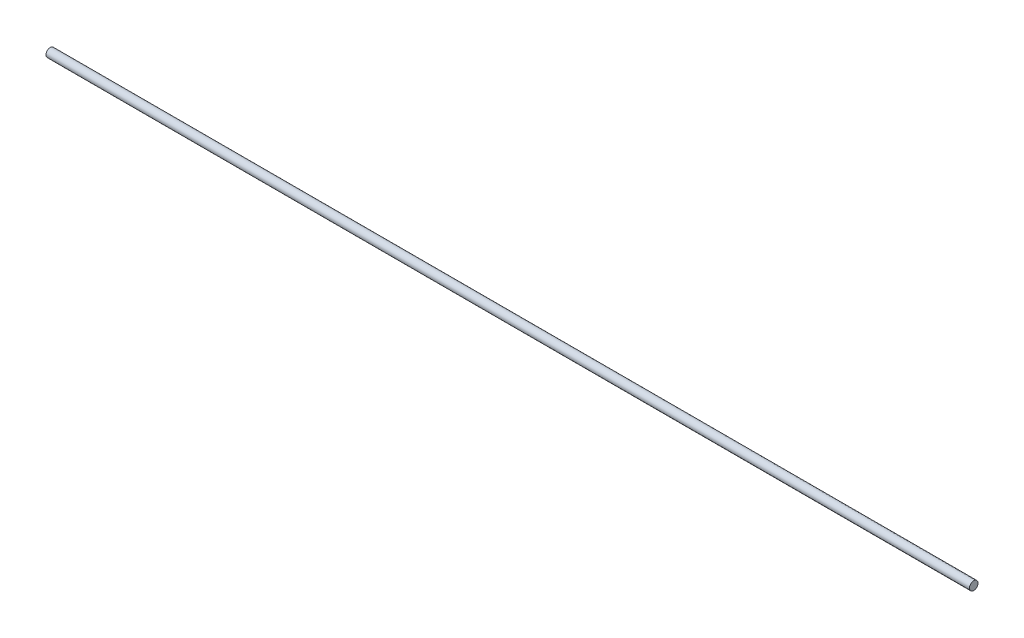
ISO-10303-21;
HEADER;
FILE_DESCRIPTION(('STEP AP214'),'2;1');
FILE_NAME('part.step','',(''),(''),'','','');
FILE_SCHEMA(('AUTOMOTIVE_DESIGN { 1 0 10303 214 1 1 1 1 }'));
ENDSEC;
DATA;
#1=APPLICATION_CONTEXT('core data for automotive mechanical design processes');
#2=APPLICATION_PROTOCOL_DEFINITION('international standard','automotive_design',2000,#1);
#3=PRODUCT_CONTEXT('',#1,'mechanical');
#4=PRODUCT('Part','Part','',(#3));
#5=PRODUCT_RELATED_PRODUCT_CATEGORY('part','',(#4));
#6=PRODUCT_DEFINITION_FORMATION('','',#4);
#7=PRODUCT_DEFINITION_CONTEXT('part definition',#1,'design');
#8=PRODUCT_DEFINITION('design','',#6,#7);
#9=PRODUCT_DEFINITION_SHAPE('','',#8);
#10=(LENGTH_UNIT() NAMED_UNIT(*) SI_UNIT(.MILLI.,.METRE.));
#11=(NAMED_UNIT(*) PLANE_ANGLE_UNIT() SI_UNIT($,.RADIAN.));
#12=(NAMED_UNIT(*) SI_UNIT($,.STERADIAN.) SOLID_ANGLE_UNIT());
#13=UNCERTAINTY_MEASURE_WITH_UNIT(LENGTH_MEASURE(1.E-05),#10,'distance_accuracy_value','');
#14=(GEOMETRIC_REPRESENTATION_CONTEXT(3) GLOBAL_UNCERTAINTY_ASSIGNED_CONTEXT((#13)) GLOBAL_UNIT_ASSIGNED_CONTEXT((#10,
#11,#12)) REPRESENTATION_CONTEXT('',''));
#15=CARTESIAN_POINT('',(0.,0.,0.));
#16=DIRECTION('',(0.,0.,1.));
#17=DIRECTION('',(1.,0.,0.));
#18=AXIS2_PLACEMENT_3D('',#15,#16,#17);
#19=CARTESIAN_POINT('',(92.,0.,0.));
#20=DIRECTION('',(-1.,0.,0.));
#21=DIRECTION('',(0.,0.,1.));
#22=AXIS2_PLACEMENT_3D('',#19,#20,#21);
#23=CYLINDRICAL_SURFACE('',#22,0.425);
#24=CARTESIAN_POINT('',(92.,0.,0.));
#25=DIRECTION('',(1.,0.,0.));
#26=DIRECTION('',(0.,0.,-1.));
#27=AXIS2_PLACEMENT_3D('',#24,#25,#26);
#28=CIRCLE('',#27,0.425);
#29=CARTESIAN_POINT('',(92.,0.,-0.425));
#30=VERTEX_POINT('',#29);
#31=EDGE_CURVE('E10',#30,#30,#28,.T.);
#32=ORIENTED_EDGE('',*,*,#31,.F.);
#33=EDGE_LOOP('',(#32));
#34=FACE_BOUND('',#33,.T.);
#35=CARTESIAN_POINT('',(0.,0.,0.));
#36=DIRECTION('',(1.,0.,0.));
#37=DIRECTION('',(0.,0.,-1.));
#38=AXIS2_PLACEMENT_3D('',#35,#36,#37);
#39=CIRCLE('',#38,0.425);
#40=CARTESIAN_POINT('',(0.,0.,-0.425));
#41=VERTEX_POINT('',#40);
#42=EDGE_CURVE('E30',#41,#41,#39,.T.);
#43=ORIENTED_EDGE('',*,*,#42,.T.);
#44=EDGE_LOOP('',(#43));
#45=FACE_BOUND('',#44,.T.);
#46=ADVANCED_FACE('F24',(#34,#45),#23,.T.);
#47=CARTESIAN_POINT('',(92.,0.,0.));
#48=DIRECTION('',(1.,0.,0.));
#49=DIRECTION('',(0.,0.,-1.));
#50=AXIS2_PLACEMENT_3D('',#47,#48,#49);
#51=PLANE('',#50);
#52=ORIENTED_EDGE('',*,*,#31,.T.);
#53=EDGE_LOOP('',(#52));
#54=FACE_BOUND('',#53,.T.);
#55=ADVANCED_FACE('F39',(#54),#51,.T.);
#56=CARTESIAN_POINT('',(0.,0.,0.));
#57=DIRECTION('',(1.,0.,0.));
#58=DIRECTION('',(0.,0.,-1.));
#59=AXIS2_PLACEMENT_3D('',#56,#57,#58);
#60=PLANE('',#59);
#61=ORIENTED_EDGE('',*,*,#42,.F.);
#62=EDGE_LOOP('',(#61));
#63=FACE_BOUND('',#62,.T.);
#64=ADVANCED_FACE('F37',(#63),#60,.F.);
#65=CLOSED_SHELL('',(#46,#55,#64));
#66=MANIFOLD_SOLID_BREP('B2',#65);
#67=ADVANCED_BREP_SHAPE_REPRESENTATION('',(#18,#66),#14);
#68=SHAPE_DEFINITION_REPRESENTATION(#9,#67);
ENDSEC;
END-ISO-10303-21;
